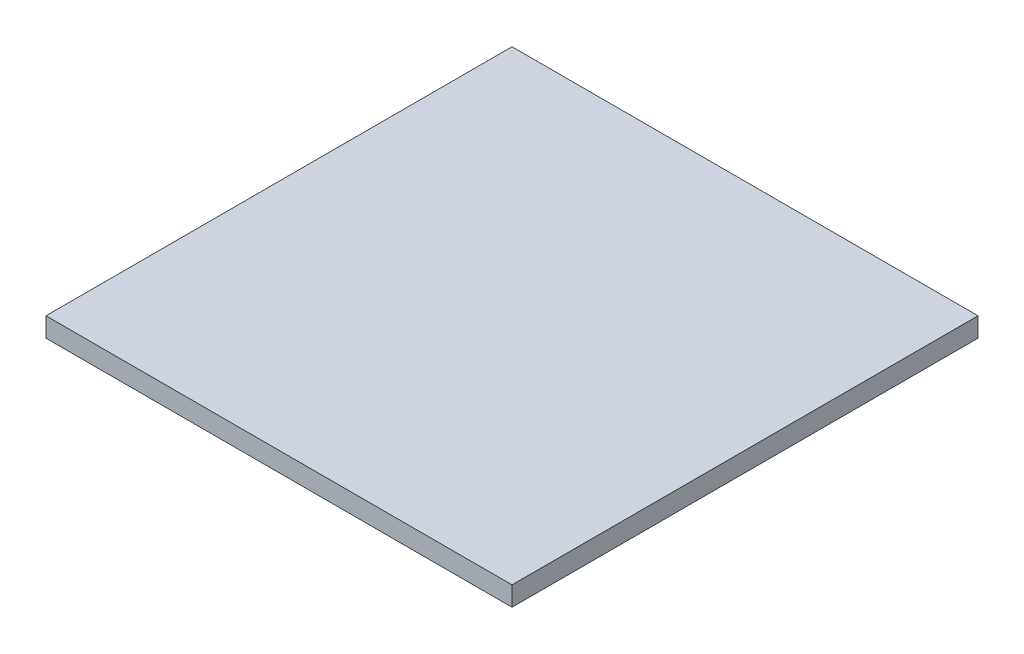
ISO-10303-21;
HEADER;
FILE_DESCRIPTION(('STEP AP214'),'2;1');
FILE_NAME('part.step','',(''),(''),'','','');
FILE_SCHEMA(('AUTOMOTIVE_DESIGN { 1 0 10303 214 1 1 1 1 }'));
ENDSEC;
DATA;
#1=APPLICATION_CONTEXT('core data for automotive mechanical design processes');
#2=APPLICATION_PROTOCOL_DEFINITION('international standard','automotive_design',2000,#1);
#3=PRODUCT_CONTEXT('',#1,'mechanical');
#4=PRODUCT('Part','Part','',(#3));
#5=PRODUCT_RELATED_PRODUCT_CATEGORY('part','',(#4));
#6=PRODUCT_DEFINITION_FORMATION('','',#4);
#7=PRODUCT_DEFINITION_CONTEXT('part definition',#1,'design');
#8=PRODUCT_DEFINITION('design','',#6,#7);
#9=PRODUCT_DEFINITION_SHAPE('','',#8);
#10=(LENGTH_UNIT() NAMED_UNIT(*) SI_UNIT(.MILLI.,.METRE.));
#11=(NAMED_UNIT(*) PLANE_ANGLE_UNIT() SI_UNIT($,.RADIAN.));
#12=(NAMED_UNIT(*) SI_UNIT($,.STERADIAN.) SOLID_ANGLE_UNIT());
#13=UNCERTAINTY_MEASURE_WITH_UNIT(LENGTH_MEASURE(1.E-05),#10,'distance_accuracy_value','');
#14=(GEOMETRIC_REPRESENTATION_CONTEXT(3) GLOBAL_UNCERTAINTY_ASSIGNED_CONTEXT((#13)) GLOBAL_UNIT_ASSIGNED_CONTEXT((#10,
#11,#12)) REPRESENTATION_CONTEXT('',''));
#15=CARTESIAN_POINT('',(0.,0.,0.));
#16=DIRECTION('',(0.,0.,1.));
#17=DIRECTION('',(1.,0.,0.));
#18=AXIS2_PLACEMENT_3D('',#15,#16,#17);
#19=CARTESIAN_POINT('',(1828.8,152.4,1828.8));
#20=DIRECTION('',(-1.,0.,0.));
#21=DIRECTION('',(0.,0.,1.));
#22=AXIS2_PLACEMENT_3D('',#19,#20,#21);
#23=PLANE('',#22);
#24=DIRECTION('',(0.,0.,-1.));
#25=VECTOR('',#24,1.);
#26=CARTESIAN_POINT('',(1828.8,0.,1828.8));
#27=LINE('',#26,#25);
#28=CARTESIAN_POINT('',(1828.8,0.,1828.8));
#29=VERTEX_POINT('',#28);
#30=CARTESIAN_POINT('',(1828.8,0.,-1828.8));
#31=VERTEX_POINT('',#30);
#32=EDGE_CURVE('E96',#29,#31,#27,.T.);
#33=ORIENTED_EDGE('',*,*,#32,.T.);
#34=DIRECTION('',(0.,-1.,0.));
#35=VECTOR('',#34,1.);
#36=CARTESIAN_POINT('',(1828.8,152.4,-1828.8));
#37=LINE('',#36,#35);
#38=CARTESIAN_POINT('',(1828.8,152.4,-1828.8));
#39=VERTEX_POINT('',#38);
#40=EDGE_CURVE('E11',#39,#31,#37,.T.);
#41=ORIENTED_EDGE('',*,*,#40,.F.);
#42=DIRECTION('',(0.,0.,-1.));
#43=VECTOR('',#42,1.);
#44=CARTESIAN_POINT('',(1828.8,152.4,1828.8));
#45=LINE('',#44,#43);
#46=CARTESIAN_POINT('',(1828.8,152.4,1828.8));
#47=VERTEX_POINT('',#46);
#48=EDGE_CURVE('E84',#47,#39,#45,.T.);
#49=ORIENTED_EDGE('',*,*,#48,.F.);
#50=DIRECTION('',(0.,-1.,0.));
#51=VECTOR('',#50,1.);
#52=CARTESIAN_POINT('',(1828.8,152.4,1828.8));
#53=LINE('',#52,#51);
#54=EDGE_CURVE('E92',#47,#29,#53,.T.);
#55=ORIENTED_EDGE('',*,*,#54,.T.);
#56=EDGE_LOOP('',(#33,#41,#49,#55));
#57=FACE_BOUND('',#56,.T.);
#58=ADVANCED_FACE('F33',(#57),#23,.F.);
#59=CARTESIAN_POINT('',(-1828.8,152.4,-1828.8));
#60=DIRECTION('',(0.,0.,1.));
#61=DIRECTION('',(1.,0.,0.));
#62=AXIS2_PLACEMENT_3D('',#59,#60,#61);
#63=PLANE('',#62);
#64=DIRECTION('',(-1.,0.,0.));
#65=VECTOR('',#64,1.);
#66=CARTESIAN_POINT('',(-1828.8,0.,-1828.8));
#67=LINE('',#66,#65);
#68=CARTESIAN_POINT('',(-1828.8,0.,-1828.8));
#69=VERTEX_POINT('',#68);
#70=EDGE_CURVE('E88',#31,#69,#67,.T.);
#71=ORIENTED_EDGE('',*,*,#70,.T.);
#72=DIRECTION('',(0.,-1.,0.));
#73=VECTOR('',#72,1.);
#74=CARTESIAN_POINT('',(-1828.8,152.4,-1828.8));
#75=LINE('',#74,#73);
#76=CARTESIAN_POINT('',(-1828.8,152.4,-1828.8));
#77=VERTEX_POINT('',#76);
#78=EDGE_CURVE('E41',#77,#69,#75,.T.);
#79=ORIENTED_EDGE('',*,*,#78,.F.);
#80=DIRECTION('',(-1.,0.,0.));
#81=VECTOR('',#80,1.);
#82=CARTESIAN_POINT('',(-1828.8,152.4,-1828.8));
#83=LINE('',#82,#81);
#84=EDGE_CURVE('E79',#39,#77,#83,.T.);
#85=ORIENTED_EDGE('',*,*,#84,.F.);
#86=ORIENTED_EDGE('',*,*,#40,.T.);
#87=EDGE_LOOP('',(#71,#79,#85,#86));
#88=FACE_BOUND('',#87,.T.);
#89=ADVANCED_FACE('F87',(#88),#63,.F.);
#90=CARTESIAN_POINT('',(-1828.8,152.4,1828.8));
#91=DIRECTION('',(1.,0.,0.));
#92=DIRECTION('',(0.,0.,-1.));
#93=AXIS2_PLACEMENT_3D('',#90,#91,#92);
#94=PLANE('',#93);
#95=DIRECTION('',(0.,0.,1.));
#96=VECTOR('',#95,1.);
#97=CARTESIAN_POINT('',(-1828.8,0.,1828.8));
#98=LINE('',#97,#96);
#99=CARTESIAN_POINT('',(-1828.8,0.,1828.8));
#100=VERTEX_POINT('',#99);
#101=EDGE_CURVE('E66',#69,#100,#98,.T.);
#102=ORIENTED_EDGE('',*,*,#101,.T.);
#103=DIRECTION('',(0.,-1.,0.));
#104=VECTOR('',#103,1.);
#105=CARTESIAN_POINT('',(-1828.8,152.4,1828.8));
#106=LINE('',#105,#104);
#107=CARTESIAN_POINT('',(-1828.8,152.4,1828.8));
#108=VERTEX_POINT('',#107);
#109=EDGE_CURVE('E89',#108,#100,#106,.T.);
#110=ORIENTED_EDGE('',*,*,#109,.F.);
#111=DIRECTION('',(0.,0.,1.));
#112=VECTOR('',#111,1.);
#113=CARTESIAN_POINT('',(-1828.8,152.4,1828.8));
#114=LINE('',#113,#112);
#115=EDGE_CURVE('E82',#77,#108,#114,.T.);
#116=ORIENTED_EDGE('',*,*,#115,.F.);
#117=ORIENTED_EDGE('',*,*,#78,.T.);
#118=EDGE_LOOP('',(#102,#110,#116,#117));
#119=FACE_BOUND('',#118,.T.);
#120=ADVANCED_FACE('F90',(#119),#94,.F.);
#121=CARTESIAN_POINT('',(-1828.8,152.4,1828.8));
#122=DIRECTION('',(0.,0.,-1.));
#123=DIRECTION('',(-1.,0.,0.));
#124=AXIS2_PLACEMENT_3D('',#121,#122,#123);
#125=PLANE('',#124);
#126=DIRECTION('',(1.,0.,0.));
#127=VECTOR('',#126,1.);
#128=CARTESIAN_POINT('',(-1828.8,0.,1828.8));
#129=LINE('',#128,#127);
#130=EDGE_CURVE('E72',#100,#29,#129,.T.);
#131=ORIENTED_EDGE('',*,*,#130,.T.);
#132=ORIENTED_EDGE('',*,*,#54,.F.);
#133=DIRECTION('',(1.,0.,0.));
#134=VECTOR('',#133,1.);
#135=CARTESIAN_POINT('',(-1828.8,152.4,1828.8));
#136=LINE('',#135,#134);
#137=EDGE_CURVE('E49',#108,#47,#136,.T.);
#138=ORIENTED_EDGE('',*,*,#137,.F.);
#139=ORIENTED_EDGE('',*,*,#109,.T.);
#140=EDGE_LOOP('',(#131,#132,#138,#139));
#141=FACE_BOUND('',#140,.T.);
#142=ADVANCED_FACE('F103',(#141),#125,.F.);
#143=CARTESIAN_POINT('',(0.,152.4,0.));
#144=DIRECTION('',(0.,-1.,0.));
#145=DIRECTION('',(0.,0.,-1.));
#146=AXIS2_PLACEMENT_3D('',#143,#144,#145);
#147=PLANE('',#146);
#148=ORIENTED_EDGE('',*,*,#48,.T.);
#149=ORIENTED_EDGE('',*,*,#84,.T.);
#150=ORIENTED_EDGE('',*,*,#115,.T.);
#151=ORIENTED_EDGE('',*,*,#137,.T.);
#152=EDGE_LOOP('',(#148,#149,#150,#151));
#153=FACE_BOUND('',#152,.T.);
#154=ADVANCED_FACE('F80',(#153),#147,.F.);
#155=CARTESIAN_POINT('',(0.,0.,0.));
#156=DIRECTION('',(0.,-1.,0.));
#157=DIRECTION('',(0.,0.,-1.));
#158=AXIS2_PLACEMENT_3D('',#155,#156,#157);
#159=PLANE('',#158);
#160=ORIENTED_EDGE('',*,*,#32,.F.);
#161=ORIENTED_EDGE('',*,*,#130,.F.);
#162=ORIENTED_EDGE('',*,*,#101,.F.);
#163=ORIENTED_EDGE('',*,*,#70,.F.);
#164=EDGE_LOOP('',(#160,#161,#162,#163));
#165=FACE_BOUND('',#164,.T.);
#166=ADVANCED_FACE('F106',(#165),#159,.T.);
#167=CLOSED_SHELL('',(#58,#89,#120,#142,#154,#166));
#168=MANIFOLD_SOLID_BREP('B2',#167);
#169=ADVANCED_BREP_SHAPE_REPRESENTATION('',(#18,#168),#14);
#170=SHAPE_DEFINITION_REPRESENTATION(#9,#169);
ENDSEC;
END-ISO-10303-21;
